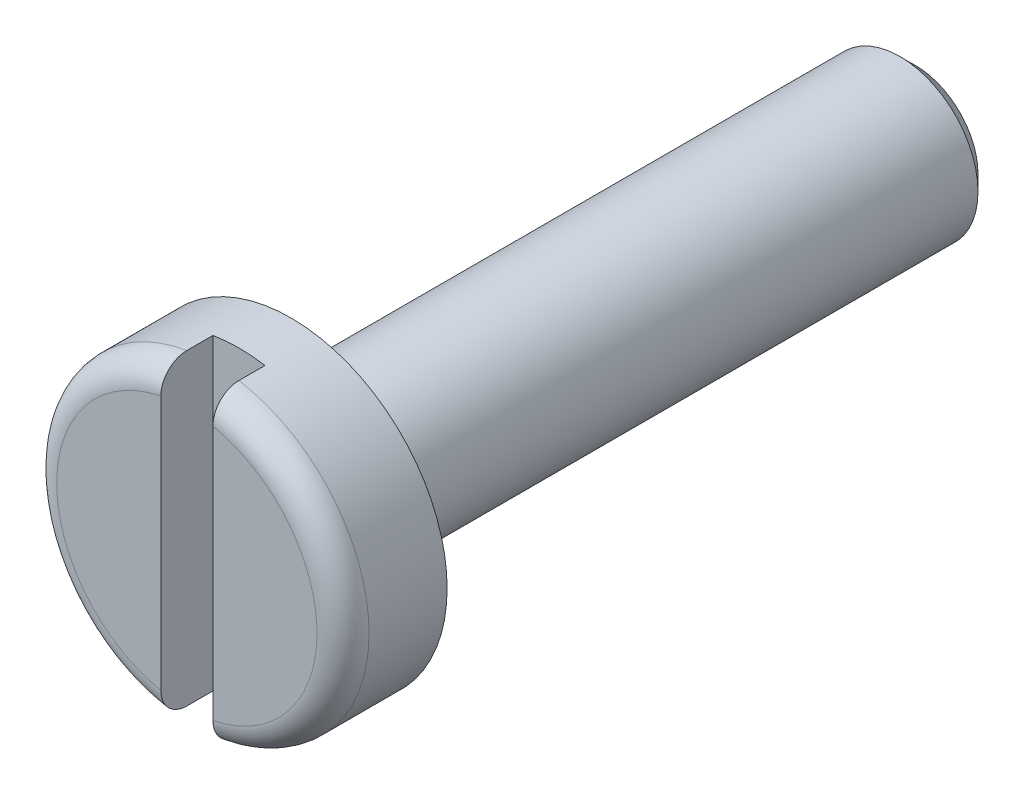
ISO-10303-21;
HEADER;
FILE_DESCRIPTION(('STEP AP214'),'2;1');
FILE_NAME('part.step','',(''),(''),'','','');
FILE_SCHEMA(('AUTOMOTIVE_DESIGN { 1 0 10303 214 1 1 1 1 }'));
ENDSEC;
DATA;
#1=APPLICATION_CONTEXT('core data for automotive mechanical design processes');
#2=APPLICATION_PROTOCOL_DEFINITION('international standard','automotive_design',2000,#1);
#3=PRODUCT_CONTEXT('',#1,'mechanical');
#4=PRODUCT('Part','Part','',(#3));
#5=PRODUCT_RELATED_PRODUCT_CATEGORY('part','',(#4));
#6=PRODUCT_DEFINITION_FORMATION('','',#4);
#7=PRODUCT_DEFINITION_CONTEXT('part definition',#1,'design');
#8=PRODUCT_DEFINITION('design','',#6,#7);
#9=PRODUCT_DEFINITION_SHAPE('','',#8);
#10=(LENGTH_UNIT() NAMED_UNIT(*) SI_UNIT(.MILLI.,.METRE.));
#11=(NAMED_UNIT(*) PLANE_ANGLE_UNIT() SI_UNIT($,.RADIAN.));
#12=(NAMED_UNIT(*) SI_UNIT($,.STERADIAN.) SOLID_ANGLE_UNIT());
#13=UNCERTAINTY_MEASURE_WITH_UNIT(LENGTH_MEASURE(1.E-05),#10,'distance_accuracy_value','');
#14=(GEOMETRIC_REPRESENTATION_CONTEXT(3) GLOBAL_UNCERTAINTY_ASSIGNED_CONTEXT((#13)) GLOBAL_UNIT_ASSIGNED_CONTEXT((#10,
#11,#12)) REPRESENTATION_CONTEXT('',''));
#15=CARTESIAN_POINT('',(0.,0.,0.));
#16=DIRECTION('',(0.,0.,1.));
#17=DIRECTION('',(1.,0.,0.));
#18=AXIS2_PLACEMENT_3D('',#15,#16,#17);
#19=CARTESIAN_POINT('',(0.,0.,14.));
#20=DIRECTION('',(0.,0.,1.));
#21=DIRECTION('',(1.,0.,0.));
#22=AXIS2_PLACEMENT_3D('',#19,#20,#21);
#23=PLANE('',#22);
#24=DIRECTION('',(0.,-1.,0.));
#25=VECTOR('',#24,1.);
#26=CARTESIAN_POINT('',(-0.5,3.22863713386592,14.));
#27=LINE('',#26,#25);
#28=CARTESIAN_POINT('',(-0.5,2.44948974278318,14.));
#29=VERTEX_POINT('',#28);
#30=CARTESIAN_POINT('',(-0.5,-2.44948974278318,14.));
#31=VERTEX_POINT('',#30);
#32=EDGE_CURVE('E100',#29,#31,#27,.T.);
#33=ORIENTED_EDGE('',*,*,#32,.F.);
#34=CARTESIAN_POINT('',(0.,0.,14.));
#35=DIRECTION('',(0.,0.,1.));
#36=DIRECTION('',(1.,0.,0.));
#37=AXIS2_PLACEMENT_3D('',#34,#35,#36);
#38=CIRCLE('',#37,2.5);
#39=EDGE_CURVE('E112',#29,#31,#38,.T.);
#40=ORIENTED_EDGE('',*,*,#39,.T.);
#41=EDGE_LOOP('',(#33,#40));
#42=FACE_BOUND('',#41,.T.);
#43=ADVANCED_FACE('F45',(#42),#23,.T.);
#44=CARTESIAN_POINT('',(0.,0.,13.5));
#45=DIRECTION('',(0.,0.,1.));
#46=DIRECTION('',(1.,0.,0.));
#47=AXIS2_PLACEMENT_3D('',#44,#45,#46);
#48=TOROIDAL_SURFACE('',#47,2.5,0.5);
#49=CARTESIAN_POINT('',(-0.5,-2.95035211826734,13.5867324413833));
#50=CARTESIAN_POINT('',(-0.5,-2.9552262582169,13.5594415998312));
#51=CARTESIAN_POINT('',(-0.5,-2.95779886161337,13.5317194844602));
#52=CARTESIAN_POINT('',(-0.5,-2.9582489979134,13.4762150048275));
#53=CARTESIAN_POINT('',(-0.5,-2.95612106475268,13.4484326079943));
#54=CARTESIAN_POINT('',(-0.5,-2.94723003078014,13.393633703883));
#55=CARTESIAN_POINT('',(-0.5,-2.94046955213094,13.3666167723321));
#56=CARTESIAN_POINT('',(-0.5,-2.92252194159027,13.3141044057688));
#57=CARTESIAN_POINT('',(-0.5,-2.91133582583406,13.2886086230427));
#58=CARTESIAN_POINT('',(-0.5,-2.88483470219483,13.2397712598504));
#59=CARTESIAN_POINT('',(-0.5,-2.86950835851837,13.2164358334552));
#60=CARTESIAN_POINT('',(-0.5,-2.83519284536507,13.1726347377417));
#61=CARTESIAN_POINT('',(-0.5,-2.81620340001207,13.152169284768));
#62=CARTESIAN_POINT('',(-0.5,-2.77489524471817,13.1144540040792));
#63=CARTESIAN_POINT('',(-0.5,-2.75254376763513,13.0972400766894));
#64=CARTESIAN_POINT('',(-0.5,-2.70530445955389,13.0667427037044));
#65=CARTESIAN_POINT('',(-0.5,-2.68041644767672,13.0534595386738));
#66=CARTESIAN_POINT('',(-0.5,-2.62840350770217,13.0309805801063));
#67=CARTESIAN_POINT('',(-0.5,-2.60125007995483,13.0218507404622));
#68=CARTESIAN_POINT('',(-0.5,-2.54580904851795,13.0081987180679));
#69=CARTESIAN_POINT('',(-0.5,-2.51752134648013,13.0036769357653));
#70=CARTESIAN_POINT('',(-0.5,-2.46012662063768,12.9992998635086));
#71=CARTESIAN_POINT('',(-0.5,-2.4310137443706,12.9995211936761));
#72=CARTESIAN_POINT('',(-0.5,-2.37322772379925,13.004792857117));
#73=CARTESIAN_POINT('',(-0.5,-2.34455461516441,13.0098435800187));
#74=CARTESIAN_POINT('',(-0.5,-2.28814273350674,13.0247103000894));
#75=CARTESIAN_POINT('',(-0.5,-2.26041717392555,13.0345765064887));
#76=CARTESIAN_POINT('',(-0.5,-2.20701871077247,13.058832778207));
#77=CARTESIAN_POINT('',(-0.5,-2.18134585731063,13.0732229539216));
#78=CARTESIAN_POINT('',(-0.5,-2.13286586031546,13.1061112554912));
#79=CARTESIAN_POINT('',(-0.5,-2.11005221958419,13.1245997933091));
#80=CARTESIAN_POINT('',(-0.5,-2.06792695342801,13.1652124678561));
#81=CARTESIAN_POINT('',(-0.5,-2.04861500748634,13.1873362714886));
#82=CARTESIAN_POINT('',(-0.5,-2.01446117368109,13.2341509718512));
#83=CARTESIAN_POINT('',(-0.5,-1.9995404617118,13.2587843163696));
#84=CARTESIAN_POINT('',(-0.5,-1.97419007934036,13.3102630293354));
#85=CARTESIAN_POINT('',(-0.5,-1.96375954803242,13.3371079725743));
#86=CARTESIAN_POINT('',(-0.5,-1.94799923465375,13.3914112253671));
#87=CARTESIAN_POINT('',(-0.5,-1.94253032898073,13.4188291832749));
#88=CARTESIAN_POINT('',(-0.5,-1.93637923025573,13.47419566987));
#89=CARTESIAN_POINT('',(-0.5,-1.93569635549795,13.5021441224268));
#90=CARTESIAN_POINT('',(-0.5,-1.93910574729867,13.557179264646));
#91=CARTESIAN_POINT('',(-0.5,-1.94310200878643,13.5842719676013));
#92=CARTESIAN_POINT('',(-0.5,-1.95557178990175,13.637404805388));
#93=CARTESIAN_POINT('',(-0.5,-1.96404530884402,13.6634449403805));
#94=CARTESIAN_POINT('',(-0.5,-1.98522261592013,13.7138500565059));
#95=CARTESIAN_POINT('',(-0.5,-1.9979413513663,13.7382087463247));
#96=CARTESIAN_POINT('',(-0.5,-2.02719570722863,13.7845129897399));
#97=CARTESIAN_POINT('',(-0.5,-2.04373174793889,13.806458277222));
#98=CARTESIAN_POINT('',(-0.5,-2.08056612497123,13.8478818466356));
#99=CARTESIAN_POINT('',(-0.5,-2.10094523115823,13.8672882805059));
#100=CARTESIAN_POINT('',(-0.5,-2.14459530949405,13.9025172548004));
#101=CARTESIAN_POINT('',(-0.5,-2.1678666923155,13.9183392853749));
#102=CARTESIAN_POINT('',(-0.5,-2.21733710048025,13.946400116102));
#103=CARTESIAN_POINT('',(-0.5,-2.24359938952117,13.9585274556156));
#104=CARTESIAN_POINT('',(-0.5,-2.2977657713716,13.9782823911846));
#105=CARTESIAN_POINT('',(-0.5,-2.32567003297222,13.9859095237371));
#106=CARTESIAN_POINT('',(-0.5,-2.38281564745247,13.9965466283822));
#107=CARTESIAN_POINT('',(-0.5,-2.41207134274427,13.9994797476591));
#108=CARTESIAN_POINT('',(-0.5,-2.47066120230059,14.0003935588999));
#109=CARTESIAN_POINT('',(-0.5,-2.49999536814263,13.9983741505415));
#110=CARTESIAN_POINT('',(-0.5,-2.55790116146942,13.9894138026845));
#111=CARTESIAN_POINT('',(-0.5,-2.58647286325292,13.982473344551));
#112=CARTESIAN_POINT('',(-0.5,-2.64202024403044,13.9638354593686));
#113=CARTESIAN_POINT('',(-0.5,-2.66899607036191,13.9521384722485));
#114=CARTESIAN_POINT('',(-0.5,-2.72022813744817,13.9244632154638));
#115=CARTESIAN_POINT('',(-0.5,-2.744513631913,13.9085391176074));
#116=CARTESIAN_POINT('',(-0.5,-2.79001381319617,13.8727703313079));
#117=CARTESIAN_POINT('',(-0.5,-2.81122799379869,13.8529249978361));
#118=CARTESIAN_POINT('',(-0.5,-2.8496084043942,13.8102279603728));
#119=CARTESIAN_POINT('',(-0.5,-2.86683447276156,13.7874299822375));
#120=CARTESIAN_POINT('',(-0.5,-2.89712793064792,13.7392475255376));
#121=CARTESIAN_POINT('',(-0.5,-2.91020078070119,13.7138665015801));
#122=CARTESIAN_POINT('',(-0.5,-2.92766179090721,13.671346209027));
#123=CARTESIAN_POINT('',(-0.5,-2.93345883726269,13.6547709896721));
#124=CARTESIAN_POINT('',(-0.5,-2.94326182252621,13.6210988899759));
#125=CARTESIAN_POINT('',(-0.5,-2.9472677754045,13.6040020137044));
#126=CARTESIAN_POINT('',(-0.5,-2.95035211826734,13.5867324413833));
#127=B_SPLINE_CURVE_WITH_KNOTS('',3,(#49,#50,#51,#52,#53,#54,#55,#56,#57,#58,#59,#60,#61,#62,
#63,#64,#65,#66,#67,#68,#69,#70,#71,#72,#73,#74,#75,#76,#77,#78,#79,#80,#81,#82,#83,#84,#85,#86,
#87,#88,#89,#90,#91,#92,#93,#94,#95,#96,#97,#98,#99,#100,#101,#102,#103,#104,#105,#106,#107,
#108,#109,#110,#111,#112,#113,#114,#115,#116,#117,#118,#119,#120,#121,#122,#123,#124,#125,#126),
.UNSPECIFIED.,.T.,.F.,(4,2,2,2,2,2,2,2,2,2,2,2,2,2,2,2,2,2,2,2,2,2,2,2,2,2,2,2,2,2,2,2,2,2,2,2,
2,2,4),(0.,0.0831039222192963,0.166304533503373,0.249458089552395,0.3325925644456,
0.415957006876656,0.499327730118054,0.583571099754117,0.667820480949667,0.753364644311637,
0.838916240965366,0.925850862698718,1.01279249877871,1.10066065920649,1.18853096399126,
1.27619782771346,1.36385666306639,1.44982967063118,1.53578618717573,1.61925046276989,
1.70270284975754,1.78447255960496,1.86624225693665,1.94830295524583,2.03037269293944,
2.11441209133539,2.19846343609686,2.2848442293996,2.37123391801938,2.4590240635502,
2.54681598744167,2.63459932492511,2.72237454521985,2.80907507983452,2.89578988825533,
2.98110432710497,3.06630612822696,3.11889448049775,3.1714824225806),.UNSPECIFIED.);
#128=CARTESIAN_POINT('',(-0.5,-2.95803989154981,13.5));
#129=VERTEX_POINT('',#128);
#130=EDGE_CURVE('E69',#31,#129,#127,.T.);
#131=ORIENTED_EDGE('',*,*,#130,.F.);
#132=ORIENTED_EDGE('',*,*,#39,.F.);
#133=CARTESIAN_POINT('',(-0.5,1.94578845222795,13.5944555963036));
#134=CARTESIAN_POINT('',(-0.5,1.94047373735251,13.5676913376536));
#135=CARTESIAN_POINT('',(-0.5,1.93741427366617,13.540460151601));
#136=CARTESIAN_POINT('',(-0.5,1.93592664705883,13.4858519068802));
#137=CARTESIAN_POINT('',(-0.5,1.93750333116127,13.4584747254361));
#138=CARTESIAN_POINT('',(-0.5,1.94523620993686,13.404393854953));
#139=CARTESIAN_POINT('',(-0.5,1.95138916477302,13.3776897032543));
#140=CARTESIAN_POINT('',(-0.5,1.96805796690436,13.3256882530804));
#141=CARTESIAN_POINT('',(-0.5,1.97857312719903,13.3003907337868));
#142=CARTESIAN_POINT('',(-0.5,2.00371458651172,13.2516930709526));
#143=CARTESIAN_POINT('',(-0.5,2.01837080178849,13.2283083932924));
#144=CARTESIAN_POINT('',(-0.5,2.05130528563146,13.1842472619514));
#145=CARTESIAN_POINT('',(-0.5,2.06958408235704,13.1635712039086));
#146=CARTESIAN_POINT('',(-0.5,2.1097606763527,13.124926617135));
#147=CARTESIAN_POINT('',(-0.5,2.13174179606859,13.1070447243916));
#148=CARTESIAN_POINT('',(-0.5,2.1783299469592,13.0751122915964));
#149=CARTESIAN_POINT('',(-0.5,2.20293734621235,13.0610622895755));
#150=CARTESIAN_POINT('',(-0.5,2.25477190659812,13.0368255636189));
#151=CARTESIAN_POINT('',(-0.5,2.28205058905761,13.0267489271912));
#152=CARTESIAN_POINT('',(-0.5,2.3379011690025,13.0112542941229));
#153=CARTESIAN_POINT('',(-0.5,2.36647317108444,13.0058366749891));
#154=CARTESIAN_POINT('',(-0.5,2.42447780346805,12.9997756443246));
#155=CARTESIAN_POINT('',(-0.5,2.45391670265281,12.9991919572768));
#156=CARTESIAN_POINT('',(-0.5,2.51247328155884,13.0029928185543));
#157=CARTESIAN_POINT('',(-0.5,2.54159096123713,13.0073773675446));
#158=CARTESIAN_POINT('',(-0.5,2.59856027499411,13.0209963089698));
#159=CARTESIAN_POINT('',(-0.5,2.6264160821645,13.0302132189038));
#160=CARTESIAN_POINT('',(-0.5,2.6801515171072,13.0532578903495));
#161=CARTESIAN_POINT('',(-0.5,2.70603127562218,13.0670853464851));
#162=CARTESIAN_POINT('',(-0.5,2.75469065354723,13.0987594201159));
#163=CARTESIAN_POINT('',(-0.5,2.77750835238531,13.1165475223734));
#164=CARTESIAN_POINT('',(-0.5,2.8197692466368,13.1557614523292));
#165=CARTESIAN_POINT('',(-0.5,2.83921274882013,13.1771869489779));
#166=CARTESIAN_POINT('',(-0.5,2.87383046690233,13.2226821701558));
#167=CARTESIAN_POINT('',(-0.5,2.8890704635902,13.2467018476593));
#168=CARTESIAN_POINT('',(-0.5,2.91523641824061,13.296986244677));
#169=CARTESIAN_POINT('',(-0.5,2.9261627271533,13.3232507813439));
#170=CARTESIAN_POINT('',(-0.5,2.94324351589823,13.3768925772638));
#171=CARTESIAN_POINT('',(-0.5,2.94946107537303,13.404249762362));
#172=CARTESIAN_POINT('',(-0.5,2.95717759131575,13.4596213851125));
#173=CARTESIAN_POINT('',(-0.5,2.95867678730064,13.4876357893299));
#174=CARTESIAN_POINT('',(-0.5,2.95691729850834,13.5433096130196));
#175=CARTESIAN_POINT('',(-0.5,2.9536931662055,13.570970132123));
#176=CARTESIAN_POINT('',(-0.5,2.94264811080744,13.6253568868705));
#177=CARTESIAN_POINT('',(-0.5,2.93482724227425,13.6520831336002));
#178=CARTESIAN_POINT('',(-0.5,2.91482050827,13.7038604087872));
#179=CARTESIAN_POINT('',(-0.5,2.90263280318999,13.7289107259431));
#180=CARTESIAN_POINT('',(-0.5,2.87425638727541,13.7766310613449));
#181=CARTESIAN_POINT('',(-0.5,2.85806756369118,13.7993010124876));
#182=CARTESIAN_POINT('',(-0.5,2.82201972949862,13.8418169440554));
#183=CARTESIAN_POINT('',(-0.5,2.80213259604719,13.8616390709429));
#184=CARTESIAN_POINT('',(-0.5,2.75935276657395,13.8977179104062));
#185=CARTESIAN_POINT('',(-0.5,2.73645988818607,13.9139744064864));
#186=CARTESIAN_POINT('',(-0.5,2.68798257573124,13.9427059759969));
#187=CARTESIAN_POINT('',(-0.5,2.66236522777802,13.9551255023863));
#188=CARTESIAN_POINT('',(-0.5,2.6094327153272,13.9755663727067));
#189=CARTESIAN_POINT('',(-0.5,2.58211740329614,13.9835873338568));
#190=CARTESIAN_POINT('',(-0.5,2.52608361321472,13.995140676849));
#191=CARTESIAN_POINT('',(-0.5,2.49734942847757,13.9985968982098));
#192=CARTESIAN_POINT('',(-0.5,2.43970498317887,14.0007067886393));
#193=CARTESIAN_POINT('',(-0.5,2.41079470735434,13.9993600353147));
#194=CARTESIAN_POINT('',(-0.5,2.3532003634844,13.9918654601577));
#195=CARTESIAN_POINT('',(-0.5,2.32452477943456,13.9856523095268));
#196=CARTESIAN_POINT('',(-0.5,2.26861556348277,13.9685186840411));
#197=CARTESIAN_POINT('',(-0.5,2.24138195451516,13.9575981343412));
#198=CARTESIAN_POINT('',(-0.5,2.18904591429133,13.9312932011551));
#199=CARTESIAN_POINT('',(-0.5,2.16395095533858,13.9158939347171));
#200=CARTESIAN_POINT('',(-0.5,2.11673735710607,13.8810452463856));
#201=CARTESIAN_POINT('',(-0.5,2.09461934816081,13.8615949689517));
#202=CARTESIAN_POINT('',(-0.5,2.05431518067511,13.8194369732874));
#203=CARTESIAN_POINT('',(-0.5,2.03608387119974,13.7967724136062));
#204=CARTESIAN_POINT('',(-0.5,2.00383030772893,13.7486509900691));
#205=CARTESIAN_POINT('',(-0.5,1.98980208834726,13.7231981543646));
#206=CARTESIAN_POINT('',(-0.5,1.97088028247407,13.6803415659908));
#207=CARTESIAN_POINT('',(-0.5,1.96454207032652,13.6635608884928));
#208=CARTESIAN_POINT('',(-0.5,1.95374122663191,13.6294057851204));
#209=CARTESIAN_POINT('',(-0.5,1.94927856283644,13.6120313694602));
#210=CARTESIAN_POINT('',(-0.5,1.94578845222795,13.5944555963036));
#211=B_SPLINE_CURVE_WITH_KNOTS('',3,(#133,#134,#135,#136,#137,#138,#139,#140,#141,#142,#143,
#144,#145,#146,#147,#148,#149,#150,#151,#152,#153,#154,#155,#156,#157,#158,#159,#160,#161,#162,
#163,#164,#165,#166,#167,#168,#169,#170,#171,#172,#173,#174,#175,#176,#177,#178,#179,#180,#181,
#182,#183,#184,#185,#186,#187,#188,#189,#190,#191,#192,#193,#194,#195,#196,#197,#198,#199,#200,
#201,#202,#203,#204,#205,#206,#207,#208,#209,#210),.UNSPECIFIED.,.T.,.F.,(4,2,2,2,2,2,2,2,2,2,2,
2,2,2,2,2,2,2,2,2,2,2,2,2,2,2,2,2,2,2,2,2,2,2,2,2,2,2,4),(0.,0.0817950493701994,
0.163675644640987,0.245498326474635,0.327308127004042,0.40972476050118,0.492153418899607,
0.57677437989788,0.661407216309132,0.748243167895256,0.835086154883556,0.92300053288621,
1.0109149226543,1.09851342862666,1.18610613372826,1.27248175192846,1.3588495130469,
1.44377716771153,1.52869791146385,1.61245986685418,1.69621757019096,1.77936561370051,
1.86251267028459,1.94569479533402,2.02887926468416,2.11272427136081,2.19657436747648,
2.28158689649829,2.3666068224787,2.45302806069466,2.5394568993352,2.6270663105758,
2.71467711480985,2.80258244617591,2.89050636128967,2.97734529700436,3.06406039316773,
3.11777516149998,3.17148900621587),.UNSPECIFIED.);
#212=CARTESIAN_POINT('',(-0.5,2.95803989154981,13.5));
#213=VERTEX_POINT('',#212);
#214=EDGE_CURVE('E96',#213,#29,#211,.T.);
#215=ORIENTED_EDGE('',*,*,#214,.F.);
#216=CARTESIAN_POINT('',(0.,0.,13.5));
#217=DIRECTION('',(0.,0.,1.));
#218=DIRECTION('',(1.,0.,0.));
#219=AXIS2_PLACEMENT_3D('',#216,#217,#218);
#220=CIRCLE('',#219,3.);
#221=EDGE_CURVE('E123',#129,#213,#220,.F.);
#222=ORIENTED_EDGE('',*,*,#221,.F.);
#223=EDGE_LOOP('',(#131,#132,#215,#222));
#224=FACE_BOUND('',#223,.T.);
#225=ADVANCED_FACE('F115',(#224),#48,.T.);
#226=CARTESIAN_POINT('',(0.,0.,12.));
#227=DIRECTION('',(0.,0.,-1.));
#228=DIRECTION('',(-1.,0.,0.));
#229=AXIS2_PLACEMENT_3D('',#226,#227,#228);
#230=CYLINDRICAL_SURFACE('',#229,1.5);
#231=CARTESIAN_POINT('',(0.,0.,0.3));
#232=DIRECTION('',(0.,0.,1.));
#233=DIRECTION('',(1.,0.,0.));
#234=AXIS2_PLACEMENT_3D('',#231,#232,#233);
#235=CIRCLE('',#234,1.5);
#236=CARTESIAN_POINT('',(1.5,0.,0.3));
#237=VERTEX_POINT('',#236);
#238=EDGE_CURVE('E130',#237,#237,#235,.T.);
#239=ORIENTED_EDGE('',*,*,#238,.T.);
#240=EDGE_LOOP('',(#239));
#241=FACE_BOUND('',#240,.T.);
#242=CARTESIAN_POINT('',(0.,0.,12.));
#243=DIRECTION('',(0.,0.,1.));
#244=DIRECTION('',(1.,0.,0.));
#245=AXIS2_PLACEMENT_3D('',#242,#243,#244);
#246=CIRCLE('',#245,1.5);
#247=CARTESIAN_POINT('',(1.5,0.,12.));
#248=VERTEX_POINT('',#247);
#249=EDGE_CURVE('E126',#248,#248,#246,.T.);
#250=ORIENTED_EDGE('',*,*,#249,.F.);
#251=EDGE_LOOP('',(#250));
#252=FACE_BOUND('',#251,.T.);
#253=ADVANCED_FACE('F211',(#241,#252),#230,.T.);
#254=CARTESIAN_POINT('',(0.,0.,0.));
#255=DIRECTION('',(0.,0.,1.));
#256=DIRECTION('',(1.,0.,0.));
#257=AXIS2_PLACEMENT_3D('',#254,#255,#256);
#258=PLANE('',#257);
#259=CARTESIAN_POINT('',(0.,0.,0.));
#260=DIRECTION('',(0.,0.,1.));
#261=DIRECTION('',(1.,0.,0.));
#262=AXIS2_PLACEMENT_3D('',#259,#260,#261);
#263=CIRCLE('',#262,1.2);
#264=CARTESIAN_POINT('',(1.2,0.,0.));
#265=VERTEX_POINT('',#264);
#266=EDGE_CURVE('E134',#265,#265,#263,.F.);
#267=ORIENTED_EDGE('',*,*,#266,.T.);
#268=EDGE_LOOP('',(#267));
#269=FACE_BOUND('',#268,.T.);
#270=ADVANCED_FACE('F213',(#269),#258,.F.);
#271=CARTESIAN_POINT('',(0.,0.,12.));
#272=DIRECTION('',(0.,0.,1.));
#273=DIRECTION('',(1.,0.,0.));
#274=AXIS2_PLACEMENT_3D('',#271,#272,#273);
#275=PLANE('',#274);
#276=CARTESIAN_POINT('',(0.,0.,12.));
#277=DIRECTION('',(0.,0.,1.));
#278=DIRECTION('',(1.,0.,0.));
#279=AXIS2_PLACEMENT_3D('',#276,#277,#278);
#280=CIRCLE('',#279,3.);
#281=CARTESIAN_POINT('',(3.,0.,12.));
#282=VERTEX_POINT('',#281);
#283=EDGE_CURVE('E201',#282,#282,#280,.T.);
#284=ORIENTED_EDGE('',*,*,#283,.F.);
#285=EDGE_LOOP('',(#284));
#286=FACE_BOUND('',#285,.T.);
#287=ORIENTED_EDGE('',*,*,#249,.T.);
#288=EDGE_LOOP('',(#287));
#289=FACE_BOUND('',#288,.T.);
#290=ADVANCED_FACE('F209',(#286,#289),#275,.F.);
#291=CARTESIAN_POINT('',(0.,0.,14.));
#292=DIRECTION('',(0.,0.,-1.));
#293=DIRECTION('',(-1.,0.,0.));
#294=AXIS2_PLACEMENT_3D('',#291,#292,#293);
#295=CYLINDRICAL_SURFACE('',#294,3.);
#296=ORIENTED_EDGE('',*,*,#221,.T.);
#297=DIRECTION('',(0.,0.,-1.));
#298=VECTOR('',#297,1.);
#299=CARTESIAN_POINT('',(-0.5,2.95803989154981,14.));
#300=LINE('',#299,#298);
#301=CARTESIAN_POINT('',(-0.5,2.95803989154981,13.));
#302=VERTEX_POINT('',#301);
#303=EDGE_CURVE('E102',#213,#302,#300,.T.);
#304=ORIENTED_EDGE('',*,*,#303,.T.);
#305=CARTESIAN_POINT('',(0.,0.,13.));
#306=DIRECTION('',(0.,0.,1.));
#307=DIRECTION('',(1.,0.,0.));
#308=AXIS2_PLACEMENT_3D('',#305,#306,#307);
#309=CIRCLE('',#308,3.);
#310=CARTESIAN_POINT('',(0.5,2.95803989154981,13.));
#311=VERTEX_POINT('',#310);
#312=EDGE_CURVE('E11',#311,#302,#309,.T.);
#313=ORIENTED_EDGE('',*,*,#312,.F.);
#314=DIRECTION('',(0.,0.,-1.));
#315=VECTOR('',#314,1.);
#316=CARTESIAN_POINT('',(0.5,2.95803989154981,14.));
#317=LINE('',#316,#315);
#318=CARTESIAN_POINT('',(0.5,2.95803989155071,13.4999999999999));
#319=VERTEX_POINT('',#318);
#320=EDGE_CURVE('E185',#311,#319,#317,.F.);
#321=ORIENTED_EDGE('',*,*,#320,.T.);
#322=CARTESIAN_POINT('',(0.5,-2.95803989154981,13.5));
#323=VERTEX_POINT('',#322);
#324=EDGE_CURVE('E117',#319,#323,#220,.F.);
#325=ORIENTED_EDGE('',*,*,#324,.T.);
#326=DIRECTION('',(0.,0.,-1.));
#327=VECTOR('',#326,1.);
#328=CARTESIAN_POINT('',(0.5,-2.95803989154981,14.));
#329=LINE('',#328,#327);
#330=CARTESIAN_POINT('',(0.5,-2.95803989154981,13.));
#331=VERTEX_POINT('',#330);
#332=EDGE_CURVE('E182',#323,#331,#329,.T.);
#333=ORIENTED_EDGE('',*,*,#332,.T.);
#334=CARTESIAN_POINT('',(-0.5,-2.95803989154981,13.));
#335=VERTEX_POINT('',#334);
#336=EDGE_CURVE('E49',#335,#331,#309,.T.);
#337=ORIENTED_EDGE('',*,*,#336,.F.);
#338=DIRECTION('',(0.,0.,-1.));
#339=VECTOR('',#338,1.);
#340=CARTESIAN_POINT('',(-0.5,-2.95803989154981,14.));
#341=LINE('',#340,#339);
#342=EDGE_CURVE('E195',#335,#129,#341,.F.);
#343=ORIENTED_EDGE('',*,*,#342,.T.);
#344=EDGE_LOOP('',(#296,#304,#313,#321,#325,#333,#337,#343));
#345=FACE_BOUND('',#344,.T.);
#346=ORIENTED_EDGE('',*,*,#283,.T.);
#347=EDGE_LOOP('',(#346));
#348=FACE_BOUND('',#347,.T.);
#349=ADVANCED_FACE('F188',(#345,#348),#295,.T.);
#350=DIRECTION('',(0.,1.,0.));
#351=VECTOR('',#350,1.);
#352=CARTESIAN_POINT('',(0.5,3.22863713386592,14.));
#353=LINE('',#352,#351);
#354=CARTESIAN_POINT('',(0.5,-2.44948974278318,14.));
#355=VERTEX_POINT('',#354);
#356=CARTESIAN_POINT('',(0.5,2.44948974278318,14.));
#357=VERTEX_POINT('',#356);
#358=EDGE_CURVE('E61',#355,#357,#353,.T.);
#359=ORIENTED_EDGE('',*,*,#358,.F.);
#360=EDGE_CURVE('E118',#355,#357,#38,.T.);
#361=ORIENTED_EDGE('',*,*,#360,.T.);
#362=EDGE_LOOP('',(#359,#361));
#363=FACE_BOUND('',#362,.T.);
#364=ADVANCED_FACE('F161',(#363),#23,.T.);
#365=CARTESIAN_POINT('',(0.5,-2.95035211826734,13.5867324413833));
#366=CARTESIAN_POINT('',(0.5,-2.9454456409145,13.6141896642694));
#367=CARTESIAN_POINT('',(0.5,-2.93820205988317,13.6412507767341));
#368=CARTESIAN_POINT('',(0.5,-2.9192538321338,13.6937886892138));
#369=CARTESIAN_POINT('',(0.5,-2.90754355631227,13.7192634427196));
#370=CARTESIAN_POINT('',(0.5,-2.88002854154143,13.7678678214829));
#371=CARTESIAN_POINT('',(0.5,-2.86422747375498,13.7909995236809));
#372=CARTESIAN_POINT('',(0.5,-2.82899978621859,13.8343013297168));
#373=CARTESIAN_POINT('',(0.5,-2.8095740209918,13.8544721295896));
#374=CARTESIAN_POINT('',(0.5,-2.76748678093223,13.891475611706));
#375=CARTESIAN_POINT('',(0.5,-2.74480029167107,13.9082798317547));
#376=CARTESIAN_POINT('',(0.5,-2.69696279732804,13.9379095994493));
#377=CARTESIAN_POINT('',(0.5,-2.67181152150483,13.950734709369));
#378=CARTESIAN_POINT('',(0.5,-2.61934293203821,13.9722559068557));
#379=CARTESIAN_POINT('',(0.5,-2.59199802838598,13.9808847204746));
#380=CARTESIAN_POINT('',(0.5,-2.53625922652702,13.9935094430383));
#381=CARTESIAN_POINT('',(0.5,-2.50786523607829,13.9975049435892));
#382=CARTESIAN_POINT('',(0.5,-2.45034814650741,14.0008087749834));
#383=CARTESIAN_POINT('',(0.5,-2.42122065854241,14.0000408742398));
#384=CARTESIAN_POINT('',(0.5,-2.36349686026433,13.993678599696));
#385=CARTESIAN_POINT('',(0.5,-2.33490059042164,13.9880838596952));
#386=CARTESIAN_POINT('',(0.5,-2.27874941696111,13.972143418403));
#387=CARTESIAN_POINT('',(0.5,-2.25120798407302,13.9617502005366));
#388=CARTESIAN_POINT('',(0.5,-2.19826616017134,13.9364741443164));
#389=CARTESIAN_POINT('',(0.5,-2.17286581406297,13.9215912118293));
#390=CARTESIAN_POINT('',(0.5,-2.1250364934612,13.8877816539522));
#391=CARTESIAN_POINT('',(0.5,-2.10259817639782,13.8688682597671));
#392=CARTESIAN_POINT('',(0.5,-2.0612946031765,13.8274733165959));
#393=CARTESIAN_POINT('',(0.5,-2.04242899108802,13.804992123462));
#394=CARTESIAN_POINT('',(0.5,-2.00923378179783,13.7575698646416));
#395=CARTESIAN_POINT('',(0.5,-1.99482061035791,13.7326873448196));
#396=CARTESIAN_POINT('',(0.5,-1.97052130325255,13.6808018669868));
#397=CARTESIAN_POINT('',(0.5,-1.96063429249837,13.6537993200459));
#398=CARTESIAN_POINT('',(0.5,-1.94596278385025,13.5992837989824));
#399=CARTESIAN_POINT('',(0.5,-1.94103840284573,13.5718084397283));
#400=CARTESIAN_POINT('',(0.5,-1.93597258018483,13.516421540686));
#401=CARTESIAN_POINT('',(0.5,-1.93583049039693,13.4885100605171));
#402=CARTESIAN_POINT('',(0.5,-1.94028963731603,13.4336082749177));
#403=CARTESIAN_POINT('',(0.5,-1.94480037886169,13.4066105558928));
#404=CARTESIAN_POINT('',(0.5,-1.95826932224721,13.3537501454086));
#405=CARTESIAN_POINT('',(0.5,-1.9672275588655,13.3278874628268));
#406=CARTESIAN_POINT('',(0.5,-1.98934771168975,13.2778758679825));
#407=CARTESIAN_POINT('',(0.5,-2.00253035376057,13.2537361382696));
#408=CARTESIAN_POINT('',(0.5,-2.03266769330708,13.2079406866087));
#409=CARTESIAN_POINT('',(0.5,-2.0496228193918,13.1862852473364));
#410=CARTESIAN_POINT('',(0.5,-2.08726367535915,13.1454963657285));
#411=CARTESIAN_POINT('',(0.5,-2.10803122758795,13.1264384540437));
#412=CARTESIAN_POINT('',(0.5,-2.15239703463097,13.0919663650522));
#413=CARTESIAN_POINT('',(0.5,-2.17599569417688,13.0765527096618));
#414=CARTESIAN_POINT('',(0.5,-2.22605207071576,13.0493755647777));
#415=CARTESIAN_POINT('',(0.5,-2.25257040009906,13.0377236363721));
#416=CARTESIAN_POINT('',(0.5,-2.30716797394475,13.0189596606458));
#417=CARTESIAN_POINT('',(0.5,-2.33524736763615,13.0118480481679));
#418=CARTESIAN_POINT('',(0.5,-2.39263302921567,13.0022833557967));
#419=CARTESIAN_POINT('',(0.5,-2.42195149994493,12.9999032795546));
#420=CARTESIAN_POINT('',(0.5,-2.48057282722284,13.0001027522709));
#421=CARTESIAN_POINT('',(0.5,-2.5098756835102,13.0026823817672));
#422=CARTESIAN_POINT('',(0.5,-2.56759806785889,13.0127511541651));
#423=CARTESIAN_POINT('',(0.5,-2.59601842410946,13.0202355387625));
#424=CARTESIAN_POINT('',(0.5,-2.6511729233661,13.039930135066));
#425=CARTESIAN_POINT('',(0.5,-2.67790715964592,13.0521400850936));
#426=CARTESIAN_POINT('',(0.5,-2.72856509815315,13.0807840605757));
#427=CARTESIAN_POINT('',(0.5,-2.75251991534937,13.0971630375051));
#428=CARTESIAN_POINT('',(0.5,-2.79727829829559,13.1337730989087));
#429=CARTESIAN_POINT('',(0.5,-2.81808227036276,13.154003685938));
#430=CARTESIAN_POINT('',(0.5,-2.85557875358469,13.1973774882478));
#431=CARTESIAN_POINT('',(0.5,-2.87233439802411,13.2204661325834));
#432=CARTESIAN_POINT('',(0.5,-2.9016683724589,13.2691690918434));
#433=CARTESIAN_POINT('',(0.5,-2.91424598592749,13.2947838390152));
#434=CARTESIAN_POINT('',(0.5,-2.93468161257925,13.3474142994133));
#435=CARTESIAN_POINT('',(0.5,-2.94260335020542,13.374405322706));
#436=CARTESIAN_POINT('',(0.5,-2.95374783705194,13.4293164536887));
#437=CARTESIAN_POINT('',(0.5,-2.95697668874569,13.4572353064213));
#438=CARTESIAN_POINT('',(0.5,-2.9583289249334,13.5021991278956));
#439=CARTESIAN_POINT('',(0.5,-2.95795841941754,13.5192125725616));
#440=CARTESIAN_POINT('',(0.5,-2.95546545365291,13.5531105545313));
#441=CARTESIAN_POINT('',(0.5,-2.95334300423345,13.5699950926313));
#442=CARTESIAN_POINT('',(0.5,-2.95035211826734,13.5867324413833));
#443=B_SPLINE_CURVE_WITH_KNOTS('',3,(#365,#366,#367,#368,#369,#370,#371,#372,#373,#374,#375,
#376,#377,#378,#379,#380,#381,#382,#383,#384,#385,#386,#387,#388,#389,#390,#391,#392,#393,#394,
#395,#396,#397,#398,#399,#400,#401,#402,#403,#404,#405,#406,#407,#408,#409,#410,#411,#412,#413,
#414,#415,#416,#417,#418,#419,#420,#421,#422,#423,#424,#425,#426,#427,#428,#429,#430,#431,#432,
#433,#434,#435,#436,#437,#438,#439,#440,#441,#442),.UNSPECIFIED.,.T.,.F.,(4,2,2,2,2,2,2,2,2,2,2,
2,2,2,2,2,2,2,2,2,2,2,2,2,2,2,2,2,2,2,2,2,2,2,2,2,2,2,4),(0.,0.0836137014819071,
0.167333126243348,0.25097767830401,0.334602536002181,0.418907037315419,0.503220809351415,
0.588845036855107,0.674476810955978,0.76148249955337,0.848494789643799,0.936387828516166,
1.02428271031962,1.1118933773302,1.19949531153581,1.28533593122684,1.37115994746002,
1.45449079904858,1.53781035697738,1.61953940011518,1.70126908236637,1.78340605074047,
1.86555235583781,1.94972825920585,2.0339162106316,2.12041043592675,2.20691294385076,
2.29474006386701,2.38256861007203,2.4703120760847,2.55805068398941,2.64468597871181,
2.73131009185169,2.81648063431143,2.90166577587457,2.98565607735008,3.06953706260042,
3.12050654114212,3.17147570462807),.UNSPECIFIED.);
#444=EDGE_CURVE('E108',#323,#355,#443,.T.);
#445=ORIENTED_EDGE('',*,*,#444,.F.);
#446=ORIENTED_EDGE('',*,*,#324,.F.);
#447=CARTESIAN_POINT('',(0.5,1.94578845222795,13.5944555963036));
#448=CARTESIAN_POINT('',(0.5,1.95120964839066,13.6217417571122));
#449=CARTESIAN_POINT('',(0.5,1.95898345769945,13.6485834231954));
#450=CARTESIAN_POINT('',(0.5,1.97897078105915,13.7005856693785));
#451=CARTESIAN_POINT('',(0.5,1.99119053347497,13.7257438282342));
#452=CARTESIAN_POINT('',(0.5,2.01963736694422,13.7736259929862));
#453=CARTESIAN_POINT('',(0.5,2.0358579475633,13.7963538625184));
#454=CARTESIAN_POINT('',(0.5,2.0718067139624,13.838826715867));
#455=CARTESIAN_POINT('',(0.5,2.09153418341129,13.8585723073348));
#456=CARTESIAN_POINT('',(0.5,2.13436259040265,13.8949725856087));
#457=CARTESIAN_POINT('',(0.5,2.15752430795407,13.9115557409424));
#458=CARTESIAN_POINT('',(0.5,2.20625040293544,13.9407084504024));
#459=CARTESIAN_POINT('',(0.5,2.2318151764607,13.9532773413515));
#460=CARTESIAN_POINT('',(0.5,2.28529106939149,13.9743420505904));
#461=CARTESIAN_POINT('',(0.5,2.31324405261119,13.9827317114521));
#462=CARTESIAN_POINT('',(0.5,2.37015666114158,13.9947480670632));
#463=CARTESIAN_POINT('',(0.5,2.39911635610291,13.9983744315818));
#464=CARTESIAN_POINT('',(0.5,2.45750476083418,14.0007642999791));
#465=CARTESIAN_POINT('',(0.5,2.48693533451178,13.9994827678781));
#466=CARTESIAN_POINT('',(0.5,2.54515819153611,13.9919663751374));
#467=CARTESIAN_POINT('',(0.5,2.57395048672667,13.9857316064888));
#468=CARTESIAN_POINT('',(0.5,2.6298852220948,13.9685065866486));
#469=CARTESIAN_POINT('',(0.5,2.65703663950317,13.9575455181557));
#470=CARTESIAN_POINT('',(0.5,2.70907333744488,13.9311529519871));
#471=CARTESIAN_POINT('',(0.5,2.73395878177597,13.9157217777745));
#472=CARTESIAN_POINT('',(0.5,2.78035529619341,13.8810703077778));
#473=CARTESIAN_POINT('',(0.5,2.80191129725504,13.8619101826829));
#474=CARTESIAN_POINT('',(0.5,2.84143357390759,13.8201886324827));
#475=CARTESIAN_POINT('',(0.5,2.85940017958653,13.7976275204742));
#476=CARTESIAN_POINT('',(0.5,2.89092278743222,13.7501457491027));
#477=CARTESIAN_POINT('',(0.5,2.90454656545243,13.7252700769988));
#478=CARTESIAN_POINT('',(0.5,2.92736275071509,13.6735632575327));
#479=CARTESIAN_POINT('',(0.5,2.93655549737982,13.6467322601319));
#480=CARTESIAN_POINT('',(0.5,2.95013725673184,13.592241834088));
#481=CARTESIAN_POINT('',(0.5,2.95458550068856,13.5645971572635));
#482=CARTESIAN_POINT('',(0.5,2.95874728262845,13.5089540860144));
#483=CARTESIAN_POINT('',(0.5,2.95846102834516,13.4809557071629));
#484=CARTESIAN_POINT('',(0.5,2.95317870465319,13.4255741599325));
#485=CARTESIAN_POINT('',(0.5,2.94821035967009,13.3981883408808));
#486=CARTESIAN_POINT('',(0.5,2.93375461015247,13.3446374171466));
#487=CARTESIAN_POINT('',(0.5,2.92426722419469,13.3184723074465));
#488=CARTESIAN_POINT('',(0.5,2.90103615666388,13.2680464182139));
#489=CARTESIAN_POINT('',(0.5,2.88728447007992,13.2437893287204));
#490=CARTESIAN_POINT('',(0.5,2.85593897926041,13.197900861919));
#491=CARTESIAN_POINT('',(0.5,2.83834504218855,13.176269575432));
#492=CARTESIAN_POINT('',(0.5,2.79964876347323,13.1360262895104));
#493=CARTESIAN_POINT('',(0.5,2.77851557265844,13.1174439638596));
#494=CARTESIAN_POINT('',(0.5,2.73346809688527,13.0840303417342));
#495=CARTESIAN_POINT('',(0.5,2.70955362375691,13.0691992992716));
#496=CARTESIAN_POINT('',(0.5,2.65925008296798,13.0434733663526));
#497=CARTESIAN_POINT('',(0.5,2.63282986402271,13.0326394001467));
#498=CARTESIAN_POINT('',(0.5,2.57856425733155,13.0154804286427));
#499=CARTESIAN_POINT('',(0.5,2.55071874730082,13.0091558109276));
#500=CARTESIAN_POINT('',(0.5,2.4939042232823,13.0010901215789));
#501=CARTESIAN_POINT('',(0.5,2.46492426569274,12.9994260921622));
#502=CARTESIAN_POINT('',(0.5,2.40708864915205,13.0009229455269));
#503=CARTESIAN_POINT('',(0.5,2.37823300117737,13.0040842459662));
#504=CARTESIAN_POINT('',(0.5,2.3210904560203,13.0152032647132));
#505=CARTESIAN_POINT('',(0.5,2.29281494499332,13.0232195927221));
#506=CARTESIAN_POINT('',(0.5,2.23800651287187,13.0438803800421));
#507=CARTESIAN_POINT('',(0.5,2.21147366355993,13.0565250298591));
#508=CARTESIAN_POINT('',(0.5,2.16090031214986,13.0861221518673));
#509=CARTESIAN_POINT('',(0.5,2.13686172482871,13.1030778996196));
#510=CARTESIAN_POINT('',(0.5,2.09203037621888,13.1408443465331));
#511=CARTESIAN_POINT('',(0.5,2.07123727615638,13.1616546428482));
#512=CARTESIAN_POINT('',(0.5,2.03386953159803,13.206198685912));
#513=CARTESIAN_POINT('',(0.5,2.017232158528,13.229879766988));
#514=CARTESIAN_POINT('',(0.5,1.98830101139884,13.2797712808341));
#515=CARTESIAN_POINT('',(0.5,1.97600759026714,13.3059819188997));
#516=CARTESIAN_POINT('',(0.5,1.95648519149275,13.3593966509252));
#517=CARTESIAN_POINT('',(0.5,1.94912484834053,13.3865528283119));
#518=CARTESIAN_POINT('',(0.5,1.93920237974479,13.4417026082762));
#519=CARTESIAN_POINT('',(0.5,1.93663328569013,13.4696949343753));
#520=CARTESIAN_POINT('',(0.5,1.93641831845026,13.5139117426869));
#521=CARTESIAN_POINT('',(0.5,1.93715872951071,13.5301444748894));
#522=CARTESIAN_POINT('',(0.5,1.94026181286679,13.5624538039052));
#523=CARTESIAN_POINT('',(0.5,1.94262444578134,13.578530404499));
#524=CARTESIAN_POINT('',(0.5,1.94578845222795,13.5944555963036));
#525=B_SPLINE_CURVE_WITH_KNOTS('',3,(#447,#448,#449,#450,#451,#452,#453,#454,#455,#456,#457,
#458,#459,#460,#461,#462,#463,#464,#465,#466,#467,#468,#469,#470,#471,#472,#473,#474,#475,#476,
#477,#478,#479,#480,#481,#482,#483,#484,#485,#486,#487,#488,#489,#490,#491,#492,#493,#494,#495,
#496,#497,#498,#499,#500,#501,#502,#503,#504,#505,#506,#507,#508,#509,#510,#511,#512,#513,#514,
#515,#516,#517,#518,#519,#520,#521,#522,#523,#524),.UNSPECIFIED.,.T.,.F.,(4,2,2,2,2,2,2,2,2,2,2,
2,2,2,2,2,2,2,2,2,2,2,2,2,2,2,2,2,2,2,2,2,2,2,2,2,2,2,4),(0.,0.083397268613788,0.16691201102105,
0.250291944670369,0.33365486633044,0.418723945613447,0.503807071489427,0.590953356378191,
0.678105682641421,0.766059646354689,0.854011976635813,0.941428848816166,1.02883939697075,
1.11494162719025,1.20103593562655,1.28571211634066,1.37038180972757,1.45398163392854,
1.53757779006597,1.6206820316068,1.70378593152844,1.78704678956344,1.87031052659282,
1.95434188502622,2.03837893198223,2.12364859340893,2.20892558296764,2.29560415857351,
2.3822902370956,2.47004424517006,2.55780186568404,2.64562636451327,2.73344168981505,
2.81983820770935,2.9062417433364,2.99024178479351,3.07411955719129,3.12279440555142,
3.17146807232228),.UNSPECIFIED.);
#526=EDGE_CURVE('E138',#357,#319,#525,.T.);
#527=ORIENTED_EDGE('',*,*,#526,.F.);
#528=ORIENTED_EDGE('',*,*,#360,.F.);
#529=EDGE_LOOP('',(#445,#446,#527,#528));
#530=FACE_BOUND('',#529,.T.);
#531=ADVANCED_FACE('F148',(#530),#48,.T.);
#532=CARTESIAN_POINT('',(0.,0.,0.3));
#533=DIRECTION('',(0.,0.,1.));
#534=DIRECTION('',(1.,0.,0.));
#535=AXIS2_PLACEMENT_3D('',#532,#533,#534);
#536=CONICAL_SURFACE('',#535,1.5,0.785398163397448);
#537=ORIENTED_EDGE('',*,*,#266,.F.);
#538=EDGE_LOOP('',(#537));
#539=FACE_BOUND('',#538,.T.);
#540=ORIENTED_EDGE('',*,*,#238,.F.);
#541=EDGE_LOOP('',(#540));
#542=FACE_BOUND('',#541,.T.);
#543=ADVANCED_FACE('F47',(#539,#542),#536,.T.);
#544=CARTESIAN_POINT('',(-0.5,-3.3817477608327,13.));
#545=DIRECTION('',(0.,0.,1.));
#546=DIRECTION('',(1.,0.,0.));
#547=AXIS2_PLACEMENT_3D('',#544,#545,#546);
#548=PLANE('',#547);
#549=ORIENTED_EDGE('',*,*,#312,.T.);
#550=DIRECTION('',(0.,-1.,0.));
#551=VECTOR('',#550,1.);
#552=CARTESIAN_POINT('',(-0.5,3.22863713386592,13.));
#553=LINE('',#552,#551);
#554=EDGE_CURVE('E179',#302,#335,#553,.T.);
#555=ORIENTED_EDGE('',*,*,#554,.T.);
#556=ORIENTED_EDGE('',*,*,#336,.T.);
#557=DIRECTION('',(0.,1.,0.));
#558=VECTOR('',#557,1.);
#559=CARTESIAN_POINT('',(0.5,3.22863713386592,13.));
#560=LINE('',#559,#558);
#561=EDGE_CURVE('E177',#331,#311,#560,.T.);
#562=ORIENTED_EDGE('',*,*,#561,.T.);
#563=EDGE_LOOP('',(#549,#555,#556,#562));
#564=FACE_BOUND('',#563,.T.);
#565=ADVANCED_FACE('F156',(#564),#548,.T.);
#566=CARTESIAN_POINT('',(-0.5,3.22863713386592,13.));
#567=DIRECTION('',(-1.,0.,0.));
#568=DIRECTION('',(0.,0.,1.));
#569=AXIS2_PLACEMENT_3D('',#566,#567,#568);
#570=PLANE('',#569);
#571=ORIENTED_EDGE('',*,*,#554,.F.);
#572=ORIENTED_EDGE('',*,*,#303,.F.);
#573=ORIENTED_EDGE('',*,*,#214,.T.);
#574=ORIENTED_EDGE('',*,*,#32,.T.);
#575=ORIENTED_EDGE('',*,*,#130,.T.);
#576=ORIENTED_EDGE('',*,*,#342,.F.);
#577=EDGE_LOOP('',(#571,#572,#573,#574,#575,#576));
#578=FACE_BOUND('',#577,.T.);
#579=ADVANCED_FACE('F99',(#578),#570,.F.);
#580=CARTESIAN_POINT('',(0.5,3.22863713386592,13.));
#581=DIRECTION('',(1.,0.,0.));
#582=DIRECTION('',(0.,0.,-1.));
#583=AXIS2_PLACEMENT_3D('',#580,#581,#582);
#584=PLANE('',#583);
#585=ORIENTED_EDGE('',*,*,#444,.T.);
#586=ORIENTED_EDGE('',*,*,#358,.T.);
#587=ORIENTED_EDGE('',*,*,#526,.T.);
#588=ORIENTED_EDGE('',*,*,#320,.F.);
#589=ORIENTED_EDGE('',*,*,#561,.F.);
#590=ORIENTED_EDGE('',*,*,#332,.F.);
#591=EDGE_LOOP('',(#585,#586,#587,#588,#589,#590));
#592=FACE_BOUND('',#591,.T.);
#593=ADVANCED_FACE('F151',(#592),#584,.F.);
#594=CLOSED_SHELL('',(#43,#225,#253,#270,#290,#349,#364,#531,#543,#565,#579,#593));
#595=MANIFOLD_SOLID_BREP('B2',#594);
#596=ADVANCED_BREP_SHAPE_REPRESENTATION('',(#18,#595),#14);
#597=SHAPE_DEFINITION_REPRESENTATION(#9,#596);
ENDSEC;
END-ISO-10303-21;
